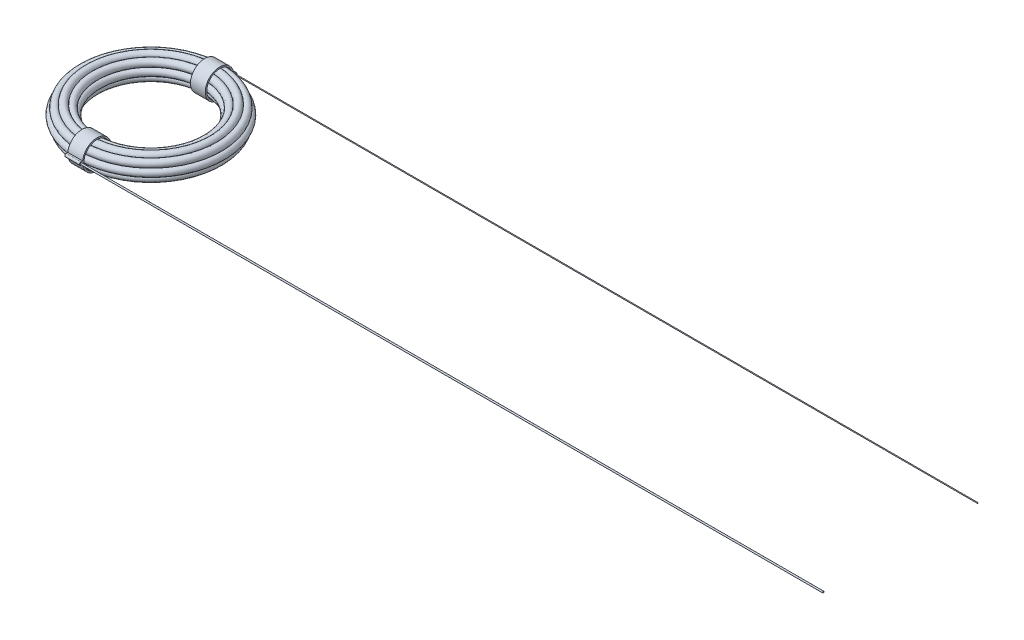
from build123d import *

# Parameters (mm, degrees)
CROQUIS51_R             = 26
SALIENTE_EXTRUIR1_DEPTH = 15
MATRIZC2_COUNT          = 2
CROQUIS55_R             = 1.5
SALIENTE_EXTRUIR2_DEPTH = 1500
CROQUIS56_R             = 0.75
SALIENTE_EXTRUIR3_DEPTH = 1500
CROQUIS57_R             = 7.5
CROQUIS57_3_R           = 7.5


with BuildPart() as part:
    # Croquis1 → Revoluci_n1 (revolve)
    with BuildSketch(Plane(origin=(0, 0, 0), x_dir=(0, 0, -1), z_dir=(1, 0, 0))):
        with BuildLine():
            ThreePointArc((-143.056659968, 7.47931345), (-150, 0), (-143.056659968, -7.47931345))
            ThreePointArc((-143.056659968, -7.47931345), (-142.67766953, -17.67766953), (-132.47931345, -18.056659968))
            ThreePointArc((-132.47931345, -18.056659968), (-125, -25), (-117.52068655, -18.056659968))
            ThreePointArc((-117.52068655, -18.056659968), (-107.32233047, -17.67766953), (-106.943340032, -7.47931345))
            ThreePointArc((-106.943340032, -7.47931345), (-100, 0), (-106.943340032, 7.47931345))
            ThreePointArc((-106.943340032, 7.47931345), (-107.32233047, 17.67766953), (-117.52068655, 18.056659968))
            ThreePointArc((-117.52068655, 18.056659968), (-125, 25), (-132.47931345, 18.056659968))
            ThreePointArc((-132.47931345, 18.056659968), (-142.67766953, 17.67766953), (-143.056659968, 7.47931345))
        make_face()
    revolve(axis=Axis((0, 26.530856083, 0), (0, -1, 0)))

    # Cortar-Barrer1: sweep along a path in Croquis54
    with BuildLine(Plane(origin=(0, 0, 0), x_dir=(1, 0, 0), z_dir=(0, 1, 0))) as cortar_barrer1_path:
        CenterArc((0, 0), 150, 0, 360)
    # Croquis57 → Cortar-Barrer1 (sweep, cut)
    with BuildSketch(Plane(origin=(0, 0, 0), x_dir=(0, 0, -1), z_dir=(1, 0, 0))):
        with Locations((-142.5, 0)):
            Circle(CROQUIS57_R)
    sweep(path=cortar_barrer1_path.line, mode=Mode.SUBTRACT)


with BuildPart() as body_2:
    # Croquis51 → Saliente-Extruir1 (new, symmetric)
    with BuildSketch(Plane(origin=(0, 0, 0), x_dir=(0, 0, -1), z_dir=(1, 0, 0))):
        with BuildLine():
            Line((-156, -3), (-152.844410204, -3))
            ThreePointArc((-152.844410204, -3), (-95, 0), (-152.844410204, 3))
            Line((-152.844410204, 3), (-156, 3))
            ThreePointArc((-156, 3), (-159, 0), (-156, -3))
        make_face()
        with Locations((-124, 0)):
            Circle(CROQUIS51_R, mode=Mode.SUBTRACT)
    extrude(amount=SALIENTE_EXTRUIR1_DEPTH, both=True)


with BuildPart() as matrizc2_1:
    # MatrizC2: pattern copy
    add(body_2.part.rotate(Axis((0, 26.530856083, 0), (0, -1, 0)), 1 * 360 / MATRIZC2_COUNT))


with BuildPart() as body_4:
    # Croquis55 → Saliente-Extruir2 (new body)
    with BuildSketch(Plane(origin=(15, 0, 0), x_dir=(0, 0, -1), z_dir=(1, 0, 0))):
        with Locations((-156, 0)):
            Circle(CROQUIS55_R)
    extrude(amount=SALIENTE_EXTRUIR2_DEPTH)


with BuildPart() as body_5:
    # Croquis56 → Saliente-Extruir3 (new body)
    with BuildSketch(Plane(origin=(15, 0, 0), x_dir=(0, 0, -1), z_dir=(1, 0, 0))):
        with Locations((156, 0)):
            Circle(CROQUIS56_R)
    extrude(amount=SALIENTE_EXTRUIR3_DEPTH)


with BuildPart() as body_6:
    # Barrer1: sweep along a path in Croquis54_3
    with BuildLine(Plane(origin=(0, 0, 0), x_dir=(1, 0, 0), z_dir=(0, 1, 0))) as barrer1_path:
        CenterArc((0, 0), 150, 0, 360)
    # Croquis57_3 → Barrer1 (sweep)
    with BuildSketch(Plane(origin=(0, 0, 0), x_dir=(0, 0, -1), z_dir=(1, 0, 0))):
        with Locations((-142.5, 0)):
            Circle(CROQUIS57_3_R)
    sweep(path=barrer1_path.line)


solid = Compound([part.part, body_2.part, matrizc2_1.part, body_4.part, body_5.part, body_6.part])
